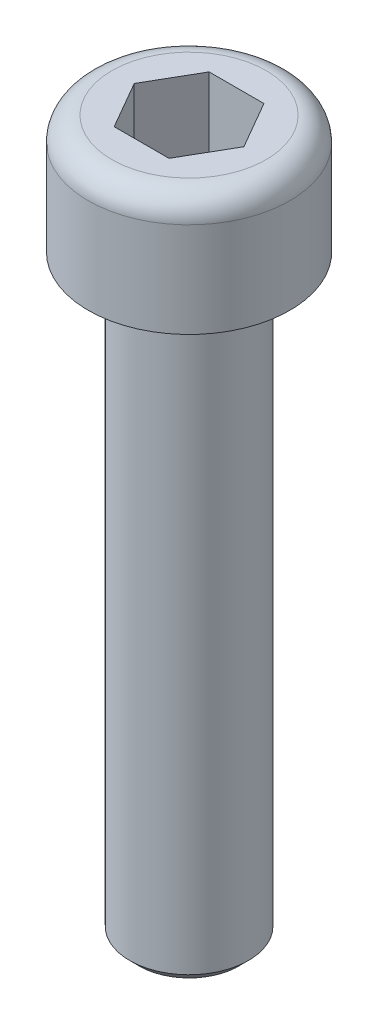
from build123d import *

# Parameters (mm, degrees)
ENL_V_MAT_EXTRU_1_DEPTH = 3.125


with BuildPart() as part:
    # Esquisse1 → R_volution1 (revolve)
    with BuildSketch(Plane.XY, mode=Mode.PRIVATE) as r_volution1_sk:
        with BuildLine():
            Line((0, 5), (3.25, 5))
            ThreePointArc((3.25, 5), (3.957106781, 4.707106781), (4.25, 4))
            Line((4.25, 4), (4.25, 0))
            Line((4.25, 0), (2.75, 0))
            ThreePointArc((2.75, 0), (2.573223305, -0.073223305), (2.5, -0.25))
            Line((2.5, -0.25), (2.5, -24.6))
            Line((2.5, -24.6), (2.1, -25))
            Line((2.1, -25), (0, -25))
            Line((0, -25), (0, 5))
        make_face()
    revolve(r_volution1_sk.sketch.rotate(Axis((0, 5, 0), (0, -1, 0)), 180), axis=Axis((0, 5, 0), (0, -1, 0)))

    # Esquisse2 → Enl_v. mat.-Extru.1 (cut)
    with BuildSketch(Plane(origin=(0, 5, 0), x_dir=(1, 0, 0), z_dir=(0, 1, 0))):
        Polygon((2.309401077, 0), (1.154700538, 2), (-1.154700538, 2), (-2.309401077, 0), (-1.154700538, -2), (1.154700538, -2), align=None)
    extrude(amount=-ENL_V_MAT_EXTRU_1_DEPTH, mode=Mode.SUBTRACT)


solid = part.part
